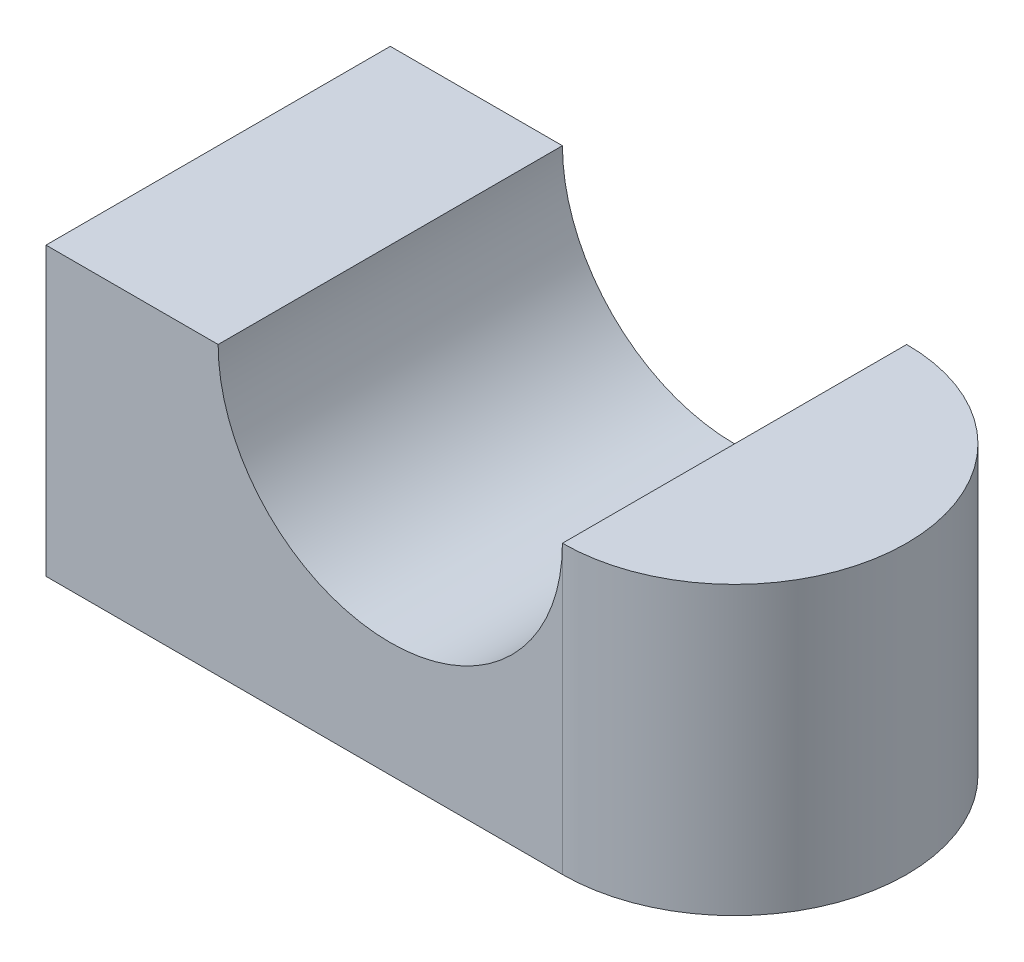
ISO-10303-21;
HEADER;
FILE_DESCRIPTION(('STEP AP214'),'2;1');
FILE_NAME('part.step','',(''),(''),'','','');
FILE_SCHEMA(('AUTOMOTIVE_DESIGN { 1 0 10303 214 1 1 1 1 }'));
ENDSEC;
DATA;
#1=APPLICATION_CONTEXT('core data for automotive mechanical design processes');
#2=APPLICATION_PROTOCOL_DEFINITION('international standard','automotive_design',2000,#1);
#3=PRODUCT_CONTEXT('',#1,'mechanical');
#4=PRODUCT('Part','Part','',(#3));
#5=PRODUCT_RELATED_PRODUCT_CATEGORY('part','',(#4));
#6=PRODUCT_DEFINITION_FORMATION('','',#4);
#7=PRODUCT_DEFINITION_CONTEXT('part definition',#1,'design');
#8=PRODUCT_DEFINITION('design','',#6,#7);
#9=PRODUCT_DEFINITION_SHAPE('','',#8);
#10=(LENGTH_UNIT() NAMED_UNIT(*) SI_UNIT(.MILLI.,.METRE.));
#11=(NAMED_UNIT(*) PLANE_ANGLE_UNIT() SI_UNIT($,.RADIAN.));
#12=(NAMED_UNIT(*) SI_UNIT($,.STERADIAN.) SOLID_ANGLE_UNIT());
#13=UNCERTAINTY_MEASURE_WITH_UNIT(LENGTH_MEASURE(1.E-05),#10,'distance_accuracy_value','');
#14=(GEOMETRIC_REPRESENTATION_CONTEXT(3) GLOBAL_UNCERTAINTY_ASSIGNED_CONTEXT((#13)) GLOBAL_UNIT_ASSIGNED_CONTEXT((#10,
#11,#12)) REPRESENTATION_CONTEXT('',''));
#15=CARTESIAN_POINT('',(0.,0.,0.));
#16=DIRECTION('',(0.,0.,1.));
#17=DIRECTION('',(1.,0.,0.));
#18=AXIS2_PLACEMENT_3D('',#15,#16,#17);
#19=CARTESIAN_POINT('',(45.,0.,0.));
#20=DIRECTION('',(0.,1.,0.));
#21=DIRECTION('',(0.,0.,1.));
#22=AXIS2_PLACEMENT_3D('',#19,#20,#21);
#23=CYLINDRICAL_SURFACE('',#22,15.);
#24=DIRECTION('',(0.,1.,0.));
#25=VECTOR('',#24,1.);
#26=CARTESIAN_POINT('',(45.,25.,15.));
#27=LINE('',#26,#25);
#28=CARTESIAN_POINT('',(45.,0.,15.));
#29=VERTEX_POINT('',#28);
#30=CARTESIAN_POINT('',(45.,25.,15.));
#31=VERTEX_POINT('',#30);
#32=EDGE_CURVE('E91',#29,#31,#27,.T.);
#33=ORIENTED_EDGE('',*,*,#32,.F.);
#34=CARTESIAN_POINT('',(45.,0.,0.));
#35=DIRECTION('',(0.,1.,0.));
#36=DIRECTION('',(0.,0.,1.));
#37=AXIS2_PLACEMENT_3D('',#34,#35,#36);
#38=CIRCLE('',#37,15.);
#39=CARTESIAN_POINT('',(45.,0.,-15.));
#40=VERTEX_POINT('',#39);
#41=EDGE_CURVE('E38',#40,#29,#38,.F.);
#42=ORIENTED_EDGE('',*,*,#41,.F.);
#43=DIRECTION('',(0.,-1.,0.));
#44=VECTOR('',#43,1.);
#45=CARTESIAN_POINT('',(45.,0.,-15.));
#46=LINE('',#45,#44);
#47=CARTESIAN_POINT('',(45.,25.,-15.));
#48=VERTEX_POINT('',#47);
#49=EDGE_CURVE('E80',#48,#40,#46,.T.);
#50=ORIENTED_EDGE('',*,*,#49,.F.);
#51=CARTESIAN_POINT('',(45.,25.,0.));
#52=DIRECTION('',(0.,-1.,0.));
#53=DIRECTION('',(0.,0.,-1.));
#54=AXIS2_PLACEMENT_3D('',#51,#52,#53);
#55=CIRCLE('',#54,15.);
#56=EDGE_CURVE('E11',#31,#48,#55,.F.);
#57=ORIENTED_EDGE('',*,*,#56,.F.);
#58=EDGE_LOOP('',(#33,#42,#50,#57));
#59=FACE_BOUND('',#58,.T.);
#60=ADVANCED_FACE('F31',(#59),#23,.T.);
#61=CARTESIAN_POINT('',(0.,25.,15.));
#62=DIRECTION('',(1.,0.,0.));
#63=DIRECTION('',(0.,1.,0.));
#64=AXIS2_PLACEMENT_3D('',#61,#62,#63);
#65=PLANE('',#64);
#66=DIRECTION('',(0.,-1.,0.));
#67=VECTOR('',#66,1.);
#68=CARTESIAN_POINT('',(0.,25.,-15.));
#69=LINE('',#68,#67);
#70=CARTESIAN_POINT('',(0.,25.,-15.));
#71=VERTEX_POINT('',#70);
#72=CARTESIAN_POINT('',(0.,0.,-15.));
#73=VERTEX_POINT('',#72);
#74=EDGE_CURVE('E79',#71,#73,#69,.T.);
#75=ORIENTED_EDGE('',*,*,#74,.T.);
#76=DIRECTION('',(0.,0.,-1.));
#77=VECTOR('',#76,1.);
#78=CARTESIAN_POINT('',(0.,0.,15.));
#79=LINE('',#78,#77);
#80=CARTESIAN_POINT('',(0.,0.,15.));
#81=VERTEX_POINT('',#80);
#82=EDGE_CURVE('E84',#81,#73,#79,.T.);
#83=ORIENTED_EDGE('',*,*,#82,.F.);
#84=DIRECTION('',(0.,-1.,0.));
#85=VECTOR('',#84,1.);
#86=CARTESIAN_POINT('',(0.,25.,15.));
#87=LINE('',#86,#85);
#88=CARTESIAN_POINT('',(0.,25.,15.));
#89=VERTEX_POINT('',#88);
#90=EDGE_CURVE('E103',#89,#81,#87,.T.);
#91=ORIENTED_EDGE('',*,*,#90,.F.);
#92=DIRECTION('',(0.,0.,-1.));
#93=VECTOR('',#92,1.);
#94=CARTESIAN_POINT('',(0.,25.,15.));
#95=LINE('',#94,#93);
#96=EDGE_CURVE('E97',#89,#71,#95,.T.);
#97=ORIENTED_EDGE('',*,*,#96,.T.);
#98=EDGE_LOOP('',(#75,#83,#91,#97));
#99=FACE_BOUND('',#98,.T.);
#100=ADVANCED_FACE('F95',(#99),#65,.F.);
#101=CARTESIAN_POINT('',(0.,0.,15.));
#102=DIRECTION('',(0.,1.,0.));
#103=DIRECTION('',(0.,0.,1.));
#104=AXIS2_PLACEMENT_3D('',#101,#102,#103);
#105=PLANE('',#104);
#106=DIRECTION('',(1.,0.,0.));
#107=VECTOR('',#106,1.);
#108=CARTESIAN_POINT('',(0.,0.,-15.));
#109=LINE('',#108,#107);
#110=EDGE_CURVE('E73',#73,#40,#109,.T.);
#111=ORIENTED_EDGE('',*,*,#110,.T.);
#112=ORIENTED_EDGE('',*,*,#41,.T.);
#113=DIRECTION('',(1.,0.,0.));
#114=VECTOR('',#113,1.);
#115=CARTESIAN_POINT('',(0.,0.,15.));
#116=LINE('',#115,#114);
#117=EDGE_CURVE('E87',#81,#29,#116,.T.);
#118=ORIENTED_EDGE('',*,*,#117,.F.);
#119=ORIENTED_EDGE('',*,*,#82,.T.);
#120=EDGE_LOOP('',(#111,#112,#118,#119));
#121=FACE_BOUND('',#120,.T.);
#122=ADVANCED_FACE('F85',(#121),#105,.F.);
#123=CARTESIAN_POINT('',(60.,25.,15.));
#124=DIRECTION('',(0.,-1.,0.));
#125=DIRECTION('',(0.,0.,-1.));
#126=AXIS2_PLACEMENT_3D('',#123,#124,#125);
#127=PLANE('',#126);
#128=DIRECTION('',(0.,0.,-1.));
#129=VECTOR('',#128,1.);
#130=CARTESIAN_POINT('',(45.,25.,15.));
#131=LINE('',#130,#129);
#132=EDGE_CURVE('E92',#31,#48,#131,.T.);
#133=ORIENTED_EDGE('',*,*,#132,.F.);
#134=ORIENTED_EDGE('',*,*,#56,.T.);
#135=EDGE_LOOP('',(#133,#134));
#136=FACE_BOUND('',#135,.T.);
#137=ADVANCED_FACE('F124',(#136),#127,.F.);
#138=CARTESIAN_POINT('',(30.,25.,15.));
#139=DIRECTION('',(0.,0.,-1.));
#140=DIRECTION('',(-1.,0.,0.));
#141=AXIS2_PLACEMENT_3D('',#138,#139,#140);
#142=CYLINDRICAL_SURFACE('',#141,15.);
#143=CARTESIAN_POINT('',(30.,25.,-15.));
#144=DIRECTION('',(0.,0.,-1.));
#145=DIRECTION('',(-1.,0.,0.));
#146=AXIS2_PLACEMENT_3D('',#143,#144,#145);
#147=CIRCLE('',#146,15.);
#148=CARTESIAN_POINT('',(15.,25.,-15.));
#149=VERTEX_POINT('',#148);
#150=EDGE_CURVE('E81',#48,#149,#147,.T.);
#151=ORIENTED_EDGE('',*,*,#150,.T.);
#152=DIRECTION('',(0.,0.,-1.));
#153=VECTOR('',#152,1.);
#154=CARTESIAN_POINT('',(15.,25.,15.));
#155=LINE('',#154,#153);
#156=CARTESIAN_POINT('',(15.,25.,15.));
#157=VERTEX_POINT('',#156);
#158=EDGE_CURVE('E111',#157,#149,#155,.T.);
#159=ORIENTED_EDGE('',*,*,#158,.F.);
#160=CARTESIAN_POINT('',(30.,25.,15.));
#161=DIRECTION('',(0.,0.,-1.));
#162=DIRECTION('',(-1.,0.,0.));
#163=AXIS2_PLACEMENT_3D('',#160,#161,#162);
#164=CIRCLE('',#163,15.);
#165=EDGE_CURVE('E106',#31,#157,#164,.T.);
#166=ORIENTED_EDGE('',*,*,#165,.F.);
#167=ORIENTED_EDGE('',*,*,#132,.T.);
#168=EDGE_LOOP('',(#151,#159,#166,#167));
#169=FACE_BOUND('',#168,.T.);
#170=ADVANCED_FACE('F126',(#169),#142,.F.);
#171=CARTESIAN_POINT('',(15.,25.,15.));
#172=DIRECTION('',(0.,-1.,0.));
#173=DIRECTION('',(1.,0.,0.));
#174=AXIS2_PLACEMENT_3D('',#171,#172,#173);
#175=PLANE('',#174);
#176=DIRECTION('',(-1.,0.,0.));
#177=VECTOR('',#176,1.);
#178=CARTESIAN_POINT('',(15.,25.,-15.));
#179=LINE('',#178,#177);
#180=EDGE_CURVE('E101',#149,#71,#179,.T.);
#181=ORIENTED_EDGE('',*,*,#180,.T.);
#182=ORIENTED_EDGE('',*,*,#96,.F.);
#183=DIRECTION('',(-1.,0.,0.));
#184=VECTOR('',#183,1.);
#185=CARTESIAN_POINT('',(15.,25.,15.));
#186=LINE('',#185,#184);
#187=EDGE_CURVE('E108',#157,#89,#186,.T.);
#188=ORIENTED_EDGE('',*,*,#187,.F.);
#189=ORIENTED_EDGE('',*,*,#158,.T.);
#190=EDGE_LOOP('',(#181,#182,#188,#189));
#191=FACE_BOUND('',#190,.T.);
#192=ADVANCED_FACE('F129',(#191),#175,.F.);
#193=CARTESIAN_POINT('',(30.,25.,15.));
#194=DIRECTION('',(0.,0.,-1.));
#195=DIRECTION('',(-1.,0.,0.));
#196=AXIS2_PLACEMENT_3D('',#193,#194,#195);
#197=PLANE('',#196);
#198=ORIENTED_EDGE('',*,*,#117,.T.);
#199=ORIENTED_EDGE('',*,*,#32,.T.);
#200=ORIENTED_EDGE('',*,*,#165,.T.);
#201=ORIENTED_EDGE('',*,*,#187,.T.);
#202=ORIENTED_EDGE('',*,*,#90,.T.);
#203=EDGE_LOOP('',(#198,#199,#200,#201,#202));
#204=FACE_BOUND('',#203,.T.);
#205=ADVANCED_FACE('F120',(#204),#197,.F.);
#206=CARTESIAN_POINT('',(30.,25.,-15.));
#207=DIRECTION('',(0.,0.,-1.));
#208=DIRECTION('',(-1.,0.,0.));
#209=AXIS2_PLACEMENT_3D('',#206,#207,#208);
#210=PLANE('',#209);
#211=ORIENTED_EDGE('',*,*,#150,.F.);
#212=ORIENTED_EDGE('',*,*,#49,.T.);
#213=ORIENTED_EDGE('',*,*,#110,.F.);
#214=ORIENTED_EDGE('',*,*,#74,.F.);
#215=ORIENTED_EDGE('',*,*,#180,.F.);
#216=EDGE_LOOP('',(#211,#212,#213,#214,#215));
#217=FACE_BOUND('',#216,.T.);
#218=ADVANCED_FACE('F76',(#217),#210,.T.);
#219=CLOSED_SHELL('',(#60,#100,#122,#137,#170,#192,#205,#218));
#220=MANIFOLD_SOLID_BREP('B2',#219);
#221=ADVANCED_BREP_SHAPE_REPRESENTATION('',(#18,#220),#14);
#222=SHAPE_DEFINITION_REPRESENTATION(#9,#221);
ENDSEC;
END-ISO-10303-21;
